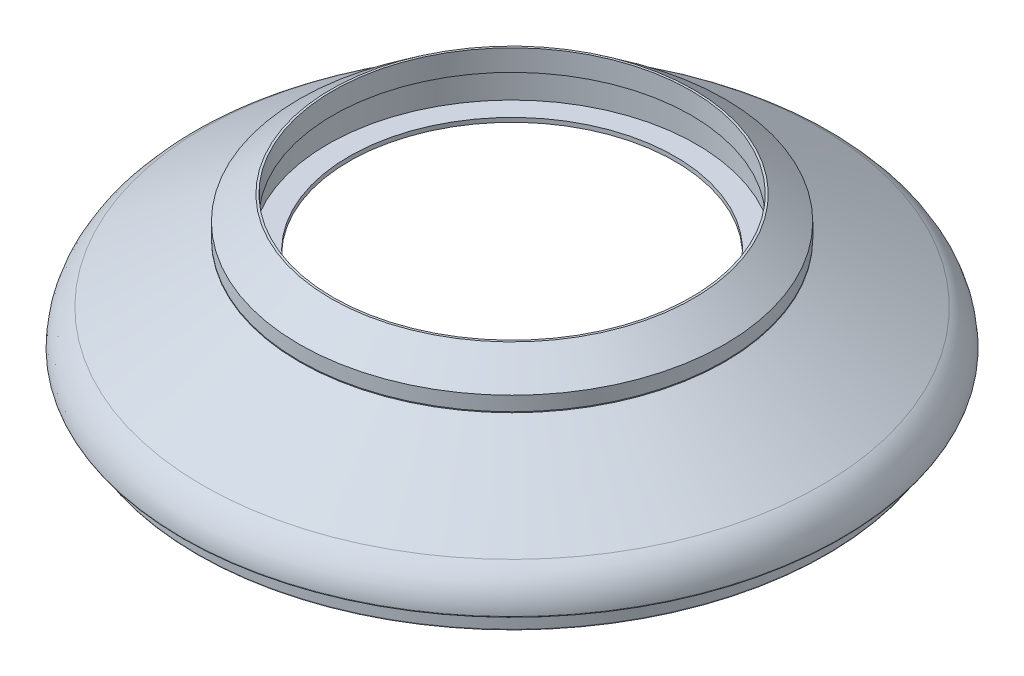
ISO-10303-21;
HEADER;
FILE_DESCRIPTION(('STEP AP214'),'2;1');
FILE_NAME('part.step','',(''),(''),'','','');
FILE_SCHEMA(('AUTOMOTIVE_DESIGN { 1 0 10303 214 1 1 1 1 }'));
ENDSEC;
DATA;
#1=APPLICATION_CONTEXT('core data for automotive mechanical design processes');
#2=APPLICATION_PROTOCOL_DEFINITION('international standard','automotive_design',2000,#1);
#3=PRODUCT_CONTEXT('',#1,'mechanical');
#4=PRODUCT('Part','Part','',(#3));
#5=PRODUCT_RELATED_PRODUCT_CATEGORY('part','',(#4));
#6=PRODUCT_DEFINITION_FORMATION('','',#4);
#7=PRODUCT_DEFINITION_CONTEXT('part definition',#1,'design');
#8=PRODUCT_DEFINITION('design','',#6,#7);
#9=PRODUCT_DEFINITION_SHAPE('','',#8);
#10=(LENGTH_UNIT() NAMED_UNIT(*) SI_UNIT(.MILLI.,.METRE.));
#11=(NAMED_UNIT(*) PLANE_ANGLE_UNIT() SI_UNIT($,.RADIAN.));
#12=(NAMED_UNIT(*) SI_UNIT($,.STERADIAN.) SOLID_ANGLE_UNIT());
#13=UNCERTAINTY_MEASURE_WITH_UNIT(LENGTH_MEASURE(1.E-05),#10,'distance_accuracy_value','');
#14=(GEOMETRIC_REPRESENTATION_CONTEXT(3) GLOBAL_UNCERTAINTY_ASSIGNED_CONTEXT((#13)) GLOBAL_UNIT_ASSIGNED_CONTEXT((#10,
#11,#12)) REPRESENTATION_CONTEXT('',''));
#15=CARTESIAN_POINT('',(0.,0.,0.));
#16=DIRECTION('',(0.,0.,1.));
#17=DIRECTION('',(1.,0.,0.));
#18=AXIS2_PLACEMENT_3D('',#15,#16,#17);
#19=CARTESIAN_POINT('',(0.,29.21,0.));
#20=DIRECTION('',(0.,-1.,0.));
#21=DIRECTION('',(0.,0.,-1.));
#22=AXIS2_PLACEMENT_3D('',#19,#20,#21);
#23=CONICAL_SURFACE('',#22,108.2167,0.919577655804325);
#24=CARTESIAN_POINT('',(0.,14.8946997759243,0.));
#25=DIRECTION('',(0.,1.,0.));
#26=DIRECTION('',(0.,0.,1.));
#27=AXIS2_PLACEMENT_3D('',#24,#25,#26);
#28=CIRCLE('',#27,127.);
#29=CARTESIAN_POINT('',(0.,14.8946997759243,127.));
#30=VERTEX_POINT('',#29);
#31=EDGE_CURVE('E10',#30,#30,#28,.T.);
#32=ORIENTED_EDGE('',*,*,#31,.T.);
#33=EDGE_LOOP('',(#32));
#34=FACE_BOUND('',#33,.T.);
#35=CARTESIAN_POINT('',(0.,29.21,0.));
#36=DIRECTION('',(0.,1.,0.));
#37=DIRECTION('',(0.,0.,1.));
#38=AXIS2_PLACEMENT_3D('',#35,#36,#37);
#39=CIRCLE('',#38,108.2167);
#40=CARTESIAN_POINT('',(0.,29.21,108.2167));
#41=VERTEX_POINT('',#40);
#42=EDGE_CURVE('E101',#41,#41,#39,.T.);
#43=ORIENTED_EDGE('',*,*,#42,.F.);
#44=EDGE_LOOP('',(#43));
#45=FACE_BOUND('',#44,.T.);
#46=ADVANCED_FACE('F31',(#34,#45),#23,.T.);
#47=CARTESIAN_POINT('',(0.,40.2244422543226,0.));
#48=DIRECTION('',(0.,1.,0.));
#49=DIRECTION('',(0.,0.,1.));
#50=AXIS2_PLACEMENT_3D('',#47,#48,#49);
#51=CYLINDRICAL_SURFACE('',#50,127.);
#52=CARTESIAN_POINT('',(0.,6.35000000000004,0.));
#53=DIRECTION('',(0.,1.,0.));
#54=DIRECTION('',(0.,0.,1.));
#55=AXIS2_PLACEMENT_3D('',#52,#53,#54);
#56=CIRCLE('',#55,127.);
#57=CARTESIAN_POINT('',(0.,6.35000000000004,127.));
#58=VERTEX_POINT('',#57);
#59=EDGE_CURVE('E37',#58,#58,#56,.T.);
#60=ORIENTED_EDGE('',*,*,#59,.T.);
#61=EDGE_LOOP('',(#60));
#62=FACE_BOUND('',#61,.T.);
#63=ORIENTED_EDGE('',*,*,#31,.F.);
#64=EDGE_LOOP('',(#63));
#65=FACE_BOUND('',#64,.T.);
#66=ADVANCED_FACE('F109',(#62,#65),#51,.T.);
#67=CARTESIAN_POINT('',(-127.,6.35000000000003,0.));
#68=DIRECTION('',(0.,-1.,0.));
#69=DIRECTION('',(0.,0.,-1.));
#70=AXIS2_PLACEMENT_3D('',#67,#68,#69);
#71=PLANE('',#70);
#72=CARTESIAN_POINT('',(0.,6.35000000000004,0.));
#73=DIRECTION('',(0.,1.,0.));
#74=DIRECTION('',(0.,0.,1.));
#75=AXIS2_PLACEMENT_3D('',#72,#73,#74);
#76=CIRCLE('',#75,119.600516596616);
#77=CARTESIAN_POINT('',(0.,6.35000000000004,119.600516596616));
#78=VERTEX_POINT('',#77);
#79=EDGE_CURVE('E41',#78,#78,#76,.T.);
#80=ORIENTED_EDGE('',*,*,#79,.T.);
#81=EDGE_LOOP('',(#80));
#82=FACE_BOUND('',#81,.T.);
#83=ORIENTED_EDGE('',*,*,#59,.F.);
#84=EDGE_LOOP('',(#83));
#85=FACE_BOUND('',#84,.T.);
#86=ADVANCED_FACE('F113',(#82,#85),#71,.T.);
#87=CARTESIAN_POINT('',(0.,40.2244422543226,0.));
#88=DIRECTION('',(0.,1.,0.));
#89=DIRECTION('',(0.,0.,1.));
#90=AXIS2_PLACEMENT_3D('',#87,#88,#89);
#91=CYLINDRICAL_SURFACE('',#90,119.600516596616);
#92=CARTESIAN_POINT('',(0.,5.84200000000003,0.));
#93=DIRECTION('',(0.,1.,0.));
#94=DIRECTION('',(0.,0.,1.));
#95=AXIS2_PLACEMENT_3D('',#92,#93,#94);
#96=CIRCLE('',#95,119.600516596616);
#97=CARTESIAN_POINT('',(0.,5.84200000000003,119.600516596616));
#98=VERTEX_POINT('',#97);
#99=EDGE_CURVE('E45',#98,#98,#96,.T.);
#100=ORIENTED_EDGE('',*,*,#99,.T.);
#101=EDGE_LOOP('',(#100));
#102=FACE_BOUND('',#101,.T.);
#103=ORIENTED_EDGE('',*,*,#79,.F.);
#104=EDGE_LOOP('',(#103));
#105=FACE_BOUND('',#104,.T.);
#106=ADVANCED_FACE('F117',(#102,#105),#91,.T.);
#107=CARTESIAN_POINT('',(-119.600516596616,5.84200000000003,0.));
#108=DIRECTION('',(0.,1.,0.));
#109=DIRECTION('',(0.,0.,1.));
#110=AXIS2_PLACEMENT_3D('',#107,#108,#109);
#111=PLANE('',#110);
#112=CARTESIAN_POINT('',(0.,5.84200000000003,0.));
#113=DIRECTION('',(0.,1.,0.));
#114=DIRECTION('',(0.,0.,1.));
#115=AXIS2_PLACEMENT_3D('',#112,#113,#114);
#116=CIRCLE('',#115,127.);
#117=CARTESIAN_POINT('',(0.,5.84200000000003,127.));
#118=VERTEX_POINT('',#117);
#119=EDGE_CURVE('E50',#118,#118,#116,.T.);
#120=ORIENTED_EDGE('',*,*,#119,.T.);
#121=EDGE_LOOP('',(#120));
#122=FACE_BOUND('',#121,.T.);
#123=ORIENTED_EDGE('',*,*,#99,.F.);
#124=EDGE_LOOP('',(#123));
#125=FACE_BOUND('',#124,.T.);
#126=ADVANCED_FACE('F124',(#122,#125),#111,.T.);
#127=CARTESIAN_POINT('',(0.,5.84200000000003,0.));
#128=DIRECTION('',(0.,-1.,0.));
#129=DIRECTION('',(0.,0.,-1.));
#130=AXIS2_PLACEMENT_3D('',#127,#128,#129);
#131=CONICAL_SURFACE('',#130,127.,1.02439215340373);
#132=CARTESIAN_POINT('',(0.,-29.2252781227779,0.));
#133=DIRECTION('',(0.,1.,0.));
#134=DIRECTION('',(0.,0.,1.));
#135=AXIS2_PLACEMENT_3D('',#132,#133,#134);
#136=CIRCLE('',#135,184.660456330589);
#137=CARTESIAN_POINT('',(0.,-29.2252781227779,184.660456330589));
#138=VERTEX_POINT('',#137);
#139=EDGE_CURVE('E53',#138,#138,#136,.T.);
#140=ORIENTED_EDGE('',*,*,#139,.T.);
#141=EDGE_LOOP('',(#140));
#142=FACE_BOUND('',#141,.T.);
#143=ORIENTED_EDGE('',*,*,#119,.F.);
#144=EDGE_LOOP('',(#143));
#145=FACE_BOUND('',#144,.T.);
#146=ADVANCED_FACE('F128',(#142,#145),#131,.T.);
#147=CARTESIAN_POINT('',(0.,-50.9269999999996,0.));
#148=DIRECTION('',(0.,1.,0.));
#149=DIRECTION('',(0.,0.,1.));
#150=AXIS2_PLACEMENT_3D('',#147,#148,#149);
#151=TOROIDAL_SURFACE('',#150,171.46215084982,25.4);
#152=CARTESIAN_POINT('',(0.,-50.1414329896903,0.));
#153=DIRECTION('',(0.,1.,0.));
#154=DIRECTION('',(0.,0.,1.));
#155=AXIS2_PLACEMENT_3D('',#152,#153,#154);
#156=CIRCLE('',#155,196.85);
#157=CARTESIAN_POINT('',(0.,-50.1414329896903,196.85));
#158=VERTEX_POINT('',#157);
#159=EDGE_CURVE('E56',#158,#158,#156,.T.);
#160=ORIENTED_EDGE('',*,*,#159,.T.);
#161=EDGE_LOOP('',(#160));
#162=FACE_BOUND('',#161,.T.);
#163=ORIENTED_EDGE('',*,*,#139,.F.);
#164=EDGE_LOOP('',(#163));
#165=FACE_BOUND('',#164,.T.);
#166=ADVANCED_FACE('F132',(#162,#165),#151,.T.);
#167=CARTESIAN_POINT('',(0.,-50.1649999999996,0.));
#168=DIRECTION('',(0.,1.,0.));
#169=DIRECTION('',(0.,0.,1.));
#170=AXIS2_PLACEMENT_3D('',#167,#168,#169);
#171=TOROIDAL_SURFACE('',#170,196.088364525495,0.762000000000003);
#172=CARTESIAN_POINT('',(0.,-50.9269999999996,0.));
#173=DIRECTION('',(0.,1.,0.));
#174=DIRECTION('',(0.,0.,1.));
#175=AXIS2_PLACEMENT_3D('',#172,#173,#174);
#176=CIRCLE('',#175,196.088364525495);
#177=CARTESIAN_POINT('',(0.,-50.9269999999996,196.088364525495));
#178=VERTEX_POINT('',#177);
#179=EDGE_CURVE('E59',#178,#178,#176,.T.);
#180=ORIENTED_EDGE('',*,*,#179,.T.);
#181=EDGE_LOOP('',(#180));
#182=FACE_BOUND('',#181,.T.);
#183=ORIENTED_EDGE('',*,*,#159,.F.);
#184=EDGE_LOOP('',(#183));
#185=FACE_BOUND('',#184,.T.);
#186=ADVANCED_FACE('F136',(#182,#185),#171,.T.);
#187=CARTESIAN_POINT('',(-196.088364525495,-50.9269999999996,0.));
#188=DIRECTION('',(0.,-1.,0.));
#189=DIRECTION('',(0.,0.,-1.));
#190=AXIS2_PLACEMENT_3D('',#187,#188,#189);
#191=PLANE('',#190);
#192=CARTESIAN_POINT('',(0.,-50.9269999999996,0.));
#193=DIRECTION('',(0.,1.,0.));
#194=DIRECTION('',(0.,0.,1.));
#195=AXIS2_PLACEMENT_3D('',#192,#193,#194);
#196=CIRCLE('',#195,193.196614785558);
#197=CARTESIAN_POINT('',(0.,-50.9269999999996,193.196614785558));
#198=VERTEX_POINT('',#197);
#199=EDGE_CURVE('E62',#198,#198,#196,.T.);
#200=ORIENTED_EDGE('',*,*,#199,.T.);
#201=EDGE_LOOP('',(#200));
#202=FACE_BOUND('',#201,.T.);
#203=ORIENTED_EDGE('',*,*,#179,.F.);
#204=EDGE_LOOP('',(#203));
#205=FACE_BOUND('',#204,.T.);
#206=ADVANCED_FACE('F140',(#202,#205),#191,.T.);
#207=CARTESIAN_POINT('',(0.,-56.0069999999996,0.));
#208=DIRECTION('',(0.,1.,0.));
#209=DIRECTION('',(0.,0.,1.));
#210=AXIS2_PLACEMENT_3D('',#207,#208,#209);
#211=TOROIDAL_SURFACE('',#210,193.196614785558,5.07999999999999);
#212=CARTESIAN_POINT('',(0.,-56.0069999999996,0.));
#213=DIRECTION('',(0.,1.,0.));
#214=DIRECTION('',(0.,0.,1.));
#215=AXIS2_PLACEMENT_3D('',#212,#213,#214);
#216=CIRCLE('',#215,188.116614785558);
#217=CARTESIAN_POINT('',(0.,-56.0069999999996,188.116614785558));
#218=VERTEX_POINT('',#217);
#219=EDGE_CURVE('E65',#218,#218,#216,.T.);
#220=ORIENTED_EDGE('',*,*,#219,.T.);
#221=EDGE_LOOP('',(#220));
#222=FACE_BOUND('',#221,.T.);
#223=ORIENTED_EDGE('',*,*,#199,.F.);
#224=EDGE_LOOP('',(#223));
#225=FACE_BOUND('',#224,.T.);
#226=ADVANCED_FACE('F144',(#222,#225),#211,.F.);
#227=CARTESIAN_POINT('',(0.,40.2244422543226,0.));
#228=DIRECTION('',(0.,1.,0.));
#229=DIRECTION('',(0.,0.,1.));
#230=AXIS2_PLACEMENT_3D('',#227,#228,#229);
#231=CYLINDRICAL_SURFACE('',#230,188.116614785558);
#232=CARTESIAN_POINT('',(0.,-62.8649999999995,0.));
#233=DIRECTION('',(0.,1.,0.));
#234=DIRECTION('',(0.,0.,1.));
#235=AXIS2_PLACEMENT_3D('',#232,#233,#234);
#236=CIRCLE('',#235,188.116614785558);
#237=CARTESIAN_POINT('',(0.,-62.8649999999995,188.116614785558));
#238=VERTEX_POINT('',#237);
#239=EDGE_CURVE('E68',#238,#238,#236,.T.);
#240=ORIENTED_EDGE('',*,*,#239,.T.);
#241=EDGE_LOOP('',(#240));
#242=FACE_BOUND('',#241,.T.);
#243=ORIENTED_EDGE('',*,*,#219,.F.);
#244=EDGE_LOOP('',(#243));
#245=FACE_BOUND('',#244,.T.);
#246=ADVANCED_FACE('F148',(#242,#245),#231,.T.);
#247=CARTESIAN_POINT('',(0.,-62.8649999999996,0.));
#248=DIRECTION('',(0.,1.,0.));
#249=DIRECTION('',(0.,0.,1.));
#250=AXIS2_PLACEMENT_3D('',#247,#248,#249);
#251=TOROIDAL_SURFACE('',#250,187.354614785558,0.762000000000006);
#252=CARTESIAN_POINT('',(0.,-63.6269999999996,0.));
#253=DIRECTION('',(0.,1.,0.));
#254=DIRECTION('',(0.,0.,1.));
#255=AXIS2_PLACEMENT_3D('',#252,#253,#254);
#256=CIRCLE('',#255,187.354614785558);
#257=CARTESIAN_POINT('',(0.,-63.6269999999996,187.354614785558));
#258=VERTEX_POINT('',#257);
#259=EDGE_CURVE('E71',#258,#258,#256,.T.);
#260=ORIENTED_EDGE('',*,*,#259,.T.);
#261=EDGE_LOOP('',(#260));
#262=FACE_BOUND('',#261,.T.);
#263=ORIENTED_EDGE('',*,*,#239,.F.);
#264=EDGE_LOOP('',(#263));
#265=FACE_BOUND('',#264,.T.);
#266=ADVANCED_FACE('F152',(#262,#265),#251,.T.);
#267=CARTESIAN_POINT('',(-187.354614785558,-63.6269999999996,0.));
#268=DIRECTION('',(0.,-1.,0.));
#269=DIRECTION('',(0.,0.,-1.));
#270=AXIS2_PLACEMENT_3D('',#267,#268,#269);
#271=PLANE('',#270);
#272=CARTESIAN_POINT('',(0.,-63.6269999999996,0.));
#273=DIRECTION('',(0.,1.,0.));
#274=DIRECTION('',(0.,0.,1.));
#275=AXIS2_PLACEMENT_3D('',#272,#273,#274);
#276=CIRCLE('',#275,184.179614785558);
#277=CARTESIAN_POINT('',(0.,-63.6269999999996,184.179614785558));
#278=VERTEX_POINT('',#277);
#279=EDGE_CURVE('E74',#278,#278,#276,.T.);
#280=ORIENTED_EDGE('',*,*,#279,.T.);
#281=EDGE_LOOP('',(#280));
#282=FACE_BOUND('',#281,.T.);
#283=ORIENTED_EDGE('',*,*,#259,.F.);
#284=EDGE_LOOP('',(#283));
#285=FACE_BOUND('',#284,.T.);
#286=ADVANCED_FACE('F156',(#282,#285),#271,.T.);
#287=CARTESIAN_POINT('',(0.,-62.8649999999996,0.));
#288=DIRECTION('',(0.,1.,0.));
#289=DIRECTION('',(0.,0.,1.));
#290=AXIS2_PLACEMENT_3D('',#287,#288,#289);
#291=TOROIDAL_SURFACE('',#290,184.179614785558,0.762000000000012);
#292=CARTESIAN_POINT('',(0.,-62.8871941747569,0.));
#293=DIRECTION('',(0.,1.,0.));
#294=DIRECTION('',(0.,0.,1.));
#295=AXIS2_PLACEMENT_3D('',#292,#293,#294);
#296=CIRCLE('',#295,183.417938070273);
#297=CARTESIAN_POINT('',(0.,-62.8871941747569,183.417938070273));
#298=VERTEX_POINT('',#297);
#299=EDGE_CURVE('E77',#298,#298,#296,.T.);
#300=ORIENTED_EDGE('',*,*,#299,.T.);
#301=EDGE_LOOP('',(#300));
#302=FACE_BOUND('',#301,.T.);
#303=ORIENTED_EDGE('',*,*,#279,.F.);
#304=EDGE_LOOP('',(#303));
#305=FACE_BOUND('',#304,.T.);
#306=ADVANCED_FACE('F160',(#302,#305),#291,.T.);
#307=CARTESIAN_POINT('',(0.,-63.6269999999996,0.));
#308=DIRECTION('',(0.,1.,0.));
#309=DIRECTION('',(0.,0.,1.));
#310=AXIS2_PLACEMENT_3D('',#307,#308,#309);
#311=TOROIDAL_SURFACE('',#310,158.028714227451,25.4);
#312=CARTESIAN_POINT('',(0.,-41.207031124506,0.));
#313=DIRECTION('',(0.,1.,0.));
#314=DIRECTION('',(0.,0.,1.));
#315=AXIS2_PLACEMENT_3D('',#312,#313,#314);
#316=CIRCLE('',#315,169.966259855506);
#317=CARTESIAN_POINT('',(0.,-41.207031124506,169.966259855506));
#318=VERTEX_POINT('',#317);
#319=EDGE_CURVE('E80',#318,#318,#316,.T.);
#320=ORIENTED_EDGE('',*,*,#319,.T.);
#321=EDGE_LOOP('',(#320));
#322=FACE_BOUND('',#321,.T.);
#323=ORIENTED_EDGE('',*,*,#299,.F.);
#324=EDGE_LOOP('',(#323));
#325=FACE_BOUND('',#324,.T.);
#326=ADVANCED_FACE('F164',(#322,#325),#311,.F.);
#327=CARTESIAN_POINT('',(0.,-41.207031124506,0.));
#328=DIRECTION('',(0.,-1.,0.));
#329=DIRECTION('',(0.,0.,-1.));
#330=AXIS2_PLACEMENT_3D('',#327,#328,#329);
#331=CONICAL_SURFACE('',#330,169.966259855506,1.08152581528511);
#332=CARTESIAN_POINT('',(0.,-2.54000000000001,0.));
#333=DIRECTION('',(0.,1.,0.));
#334=DIRECTION('',(0.,0.,1.));
#335=AXIS2_PLACEMENT_3D('',#332,#333,#334);
#336=CIRCLE('',#335,97.345499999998);
#337=CARTESIAN_POINT('',(0.,-2.54000000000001,97.345499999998));
#338=VERTEX_POINT('',#337);
#339=EDGE_CURVE('E83',#338,#338,#336,.T.);
#340=ORIENTED_EDGE('',*,*,#339,.T.);
#341=EDGE_LOOP('',(#340));
#342=FACE_BOUND('',#341,.T.);
#343=ORIENTED_EDGE('',*,*,#319,.F.);
#344=EDGE_LOOP('',(#343));
#345=FACE_BOUND('',#344,.T.);
#346=ADVANCED_FACE('F168',(#342,#345),#331,.F.);
#347=CARTESIAN_POINT('',(0.,40.2244422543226,0.));
#348=DIRECTION('',(0.,1.,0.));
#349=DIRECTION('',(0.,0.,1.));
#350=AXIS2_PLACEMENT_3D('',#347,#348,#349);
#351=CYLINDRICAL_SURFACE('',#350,97.345499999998);
#352=CARTESIAN_POINT('',(0.,0.,0.));
#353=DIRECTION('',(0.,1.,0.));
#354=DIRECTION('',(0.,0.,1.));
#355=AXIS2_PLACEMENT_3D('',#352,#353,#354);
#356=CIRCLE('',#355,97.345499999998);
#357=CARTESIAN_POINT('',(0.,0.,97.345499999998));
#358=VERTEX_POINT('',#357);
#359=EDGE_CURVE('E86',#358,#358,#356,.T.);
#360=ORIENTED_EDGE('',*,*,#359,.T.);
#361=EDGE_LOOP('',(#360));
#362=FACE_BOUND('',#361,.T.);
#363=ORIENTED_EDGE('',*,*,#339,.F.);
#364=EDGE_LOOP('',(#363));
#365=FACE_BOUND('',#364,.T.);
#366=ADVANCED_FACE('F172',(#362,#365),#351,.F.);
#367=CARTESIAN_POINT('',(-110.045499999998,0.,0.));
#368=DIRECTION('',(0.,1.,0.));
#369=DIRECTION('',(0.,0.,1.));
#370=AXIS2_PLACEMENT_3D('',#367,#368,#369);
#371=PLANE('',#370);
#372=CARTESIAN_POINT('',(0.,0.,0.));
#373=DIRECTION('',(0.,1.,0.));
#374=DIRECTION('',(0.,0.,1.));
#375=AXIS2_PLACEMENT_3D('',#372,#373,#374);
#376=CIRCLE('',#375,110.045499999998);
#377=CARTESIAN_POINT('',(0.,0.,110.045499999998));
#378=VERTEX_POINT('',#377);
#379=EDGE_CURVE('E89',#378,#378,#376,.T.);
#380=ORIENTED_EDGE('',*,*,#379,.T.);
#381=EDGE_LOOP('',(#380));
#382=FACE_BOUND('',#381,.T.);
#383=ORIENTED_EDGE('',*,*,#359,.F.);
#384=EDGE_LOOP('',(#383));
#385=FACE_BOUND('',#384,.T.);
#386=ADVANCED_FACE('F176',(#382,#385),#371,.T.);
#387=CARTESIAN_POINT('',(0.,40.2244422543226,0.));
#388=DIRECTION('',(0.,1.,0.));
#389=DIRECTION('',(0.,0.,1.));
#390=AXIS2_PLACEMENT_3D('',#387,#388,#389);
#391=CYLINDRICAL_SURFACE('',#390,110.045499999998);
#392=CARTESIAN_POINT('',(0.,16.51,0.));
#393=DIRECTION('',(0.,1.,0.));
#394=DIRECTION('',(0.,0.,1.));
#395=AXIS2_PLACEMENT_3D('',#392,#393,#394);
#396=CIRCLE('',#395,110.045499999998);
#397=CARTESIAN_POINT('',(0.,16.51,110.045499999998));
#398=VERTEX_POINT('',#397);
#399=EDGE_CURVE('E92',#398,#398,#396,.T.);
#400=ORIENTED_EDGE('',*,*,#399,.T.);
#401=EDGE_LOOP('',(#400));
#402=FACE_BOUND('',#401,.T.);
#403=ORIENTED_EDGE('',*,*,#379,.F.);
#404=EDGE_LOOP('',(#403));
#405=FACE_BOUND('',#404,.T.);
#406=ADVANCED_FACE('F180',(#402,#405),#391,.F.);
#407=CARTESIAN_POINT('',(-106.9467,16.51,0.));
#408=DIRECTION('',(0.,-1.,0.));
#409=DIRECTION('',(0.,0.,-1.));
#410=AXIS2_PLACEMENT_3D('',#407,#408,#409);
#411=PLANE('',#410);
#412=CARTESIAN_POINT('',(0.,16.51,0.));
#413=DIRECTION('',(0.,1.,0.));
#414=DIRECTION('',(0.,0.,1.));
#415=AXIS2_PLACEMENT_3D('',#412,#413,#414);
#416=CIRCLE('',#415,106.9467);
#417=CARTESIAN_POINT('',(0.,16.51,106.9467));
#418=VERTEX_POINT('',#417);
#419=EDGE_CURVE('E95',#418,#418,#416,.T.);
#420=ORIENTED_EDGE('',*,*,#419,.T.);
#421=EDGE_LOOP('',(#420));
#422=FACE_BOUND('',#421,.T.);
#423=ORIENTED_EDGE('',*,*,#399,.F.);
#424=EDGE_LOOP('',(#423));
#425=FACE_BOUND('',#424,.T.);
#426=ADVANCED_FACE('F184',(#422,#425),#411,.T.);
#427=CARTESIAN_POINT('',(0.,40.2244422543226,0.));
#428=DIRECTION('',(0.,1.,0.));
#429=DIRECTION('',(0.,0.,1.));
#430=AXIS2_PLACEMENT_3D('',#427,#428,#429);
#431=CYLINDRICAL_SURFACE('',#430,106.9467);
#432=CARTESIAN_POINT('',(0.,29.21,0.));
#433=DIRECTION('',(0.,1.,0.));
#434=DIRECTION('',(0.,0.,1.));
#435=AXIS2_PLACEMENT_3D('',#432,#433,#434);
#436=CIRCLE('',#435,106.9467);
#437=CARTESIAN_POINT('',(0.,29.21,106.9467));
#438=VERTEX_POINT('',#437);
#439=EDGE_CURVE('E98',#438,#438,#436,.T.);
#440=ORIENTED_EDGE('',*,*,#439,.T.);
#441=EDGE_LOOP('',(#440));
#442=FACE_BOUND('',#441,.T.);
#443=ORIENTED_EDGE('',*,*,#419,.F.);
#444=EDGE_LOOP('',(#443));
#445=FACE_BOUND('',#444,.T.);
#446=ADVANCED_FACE('F188',(#442,#445),#431,.F.);
#447=CARTESIAN_POINT('',(-108.2167,29.21,0.));
#448=DIRECTION('',(0.,1.,0.));
#449=DIRECTION('',(0.,0.,1.));
#450=AXIS2_PLACEMENT_3D('',#447,#448,#449);
#451=PLANE('',#450);
#452=ORIENTED_EDGE('',*,*,#42,.T.);
#453=EDGE_LOOP('',(#452));
#454=FACE_BOUND('',#453,.T.);
#455=ORIENTED_EDGE('',*,*,#439,.F.);
#456=EDGE_LOOP('',(#455));
#457=FACE_BOUND('',#456,.T.);
#458=ADVANCED_FACE('F105',(#454,#457),#451,.T.);
#459=CLOSED_SHELL('',(#46,#66,#86,#106,#126,#146,#166,#186,#206,#226,#246,#266,#286,#306,#326,
#346,#366,#386,#406,#426,#446,#458));
#460=MANIFOLD_SOLID_BREP('B2',#459);
#461=ADVANCED_BREP_SHAPE_REPRESENTATION('',(#18,#460),#14);
#462=SHAPE_DEFINITION_REPRESENTATION(#9,#461);
ENDSEC;
END-ISO-10303-21;
